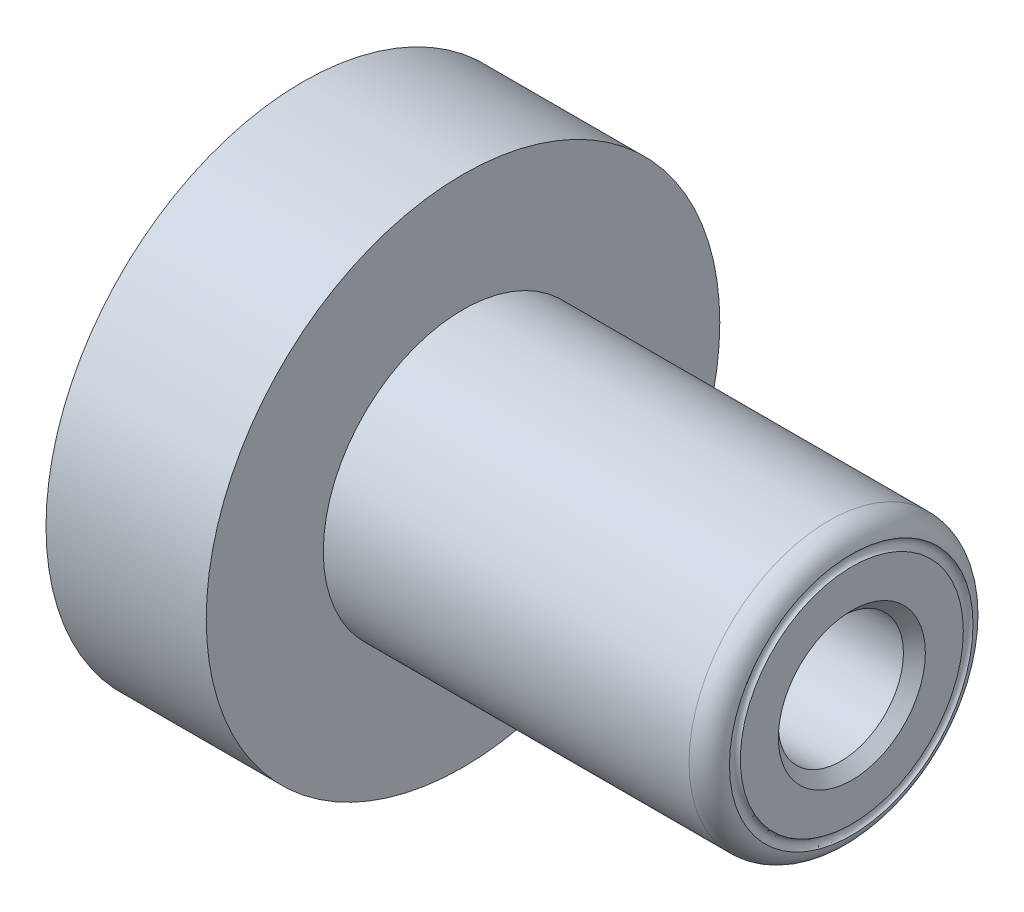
ISO-10303-21;
HEADER;
FILE_DESCRIPTION(('STEP AP214'),'2;1');
FILE_NAME('part.step','',(''),(''),'','','');
FILE_SCHEMA(('AUTOMOTIVE_DESIGN { 1 0 10303 214 1 1 1 1 }'));
ENDSEC;
DATA;
#1=APPLICATION_CONTEXT('core data for automotive mechanical design processes');
#2=APPLICATION_PROTOCOL_DEFINITION('international standard','automotive_design',2000,#1);
#3=PRODUCT_CONTEXT('',#1,'mechanical');
#4=PRODUCT('Part','Part','',(#3));
#5=PRODUCT_RELATED_PRODUCT_CATEGORY('part','',(#4));
#6=PRODUCT_DEFINITION_FORMATION('','',#4);
#7=PRODUCT_DEFINITION_CONTEXT('part definition',#1,'design');
#8=PRODUCT_DEFINITION('design','',#6,#7);
#9=PRODUCT_DEFINITION_SHAPE('','',#8);
#10=(LENGTH_UNIT() NAMED_UNIT(*) SI_UNIT(.MILLI.,.METRE.));
#11=(NAMED_UNIT(*) PLANE_ANGLE_UNIT() SI_UNIT($,.RADIAN.));
#12=(NAMED_UNIT(*) SI_UNIT($,.STERADIAN.) SOLID_ANGLE_UNIT());
#13=UNCERTAINTY_MEASURE_WITH_UNIT(LENGTH_MEASURE(1.E-05),#10,'distance_accuracy_value','');
#14=(GEOMETRIC_REPRESENTATION_CONTEXT(3) GLOBAL_UNCERTAINTY_ASSIGNED_CONTEXT((#13)) GLOBAL_UNIT_ASSIGNED_CONTEXT((#10,
#11,#12)) REPRESENTATION_CONTEXT('',''));
#15=CARTESIAN_POINT('',(0.,0.,0.));
#16=DIRECTION('',(0.,0.,1.));
#17=DIRECTION('',(1.,0.,0.));
#18=AXIS2_PLACEMENT_3D('',#15,#16,#17);
#19=CARTESIAN_POINT('',(37.338,7.9296,0.));
#20=DIRECTION('',(-1.,0.,0.));
#21=DIRECTION('',(0.,0.,1.));
#22=AXIS2_PLACEMENT_3D('',#19,#20,#21);
#23=PLANE('',#22);
#24=CARTESIAN_POINT('',(37.338,0.,0.));
#25=DIRECTION('',(-1.,0.,0.));
#26=DIRECTION('',(0.,0.,1.));
#27=AXIS2_PLACEMENT_3D('',#24,#25,#26);
#28=CIRCLE('',#27,5.);
#29=CARTESIAN_POINT('',(37.338,0.,-5.00000000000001));
#30=VERTEX_POINT('',#29);
#31=EDGE_CURVE('E10',#30,#30,#28,.T.);
#32=ORIENTED_EDGE('',*,*,#31,.T.);
#33=EDGE_LOOP('',(#32));
#34=FACE_BOUND('',#33,.T.);
#35=CARTESIAN_POINT('',(37.338,0.,0.));
#36=DIRECTION('',(1.,0.,0.));
#37=DIRECTION('',(0.,0.,-1.));
#38=AXIS2_PLACEMENT_3D('',#35,#36,#37);
#39=CIRCLE('',#38,7.58150313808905);
#40=CARTESIAN_POINT('',(37.338,0.,-7.58150313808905));
#41=VERTEX_POINT('',#40);
#42=EDGE_CURVE('E78',#41,#41,#39,.F.);
#43=ORIENTED_EDGE('',*,*,#42,.F.);
#44=EDGE_LOOP('',(#43));
#45=FACE_BOUND('',#44,.T.);
#46=ADVANCED_FACE('F31',(#34,#45),#23,.F.);
#47=CARTESIAN_POINT('',(35.768,0.,0.));
#48=DIRECTION('',(-1.,0.,0.));
#49=DIRECTION('',(0.,0.,1.));
#50=AXIS2_PLACEMENT_3D('',#47,#48,#49);
#51=TOROIDAL_SURFACE('',#50,7.9296,1.57);
#52=CARTESIAN_POINT('',(35.768,0.,0.));
#53=DIRECTION('',(-1.,0.,0.));
#54=DIRECTION('',(0.,0.,1.));
#55=AXIS2_PLACEMENT_3D('',#52,#53,#54);
#56=CIRCLE('',#55,9.4996);
#57=CARTESIAN_POINT('',(35.768,0.,9.4996));
#58=VERTEX_POINT('',#57);
#59=EDGE_CURVE('E48',#58,#58,#56,.T.);
#60=ORIENTED_EDGE('',*,*,#59,.F.);
#61=EDGE_LOOP('',(#60));
#62=FACE_BOUND('',#61,.T.);
#63=CARTESIAN_POINT('',(37.2980555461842,0.,0.));
#64=DIRECTION('',(1.,0.,0.));
#65=DIRECTION('',(0.,0.,-1.));
#66=AXIS2_PLACEMENT_3D('',#63,#64,#65);
#67=CIRCLE('',#66,8.28149490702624);
#68=CARTESIAN_POINT('',(37.2980555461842,0.,-8.28149490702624));
#69=VERTEX_POINT('',#68);
#70=EDGE_CURVE('E35',#69,#69,#67,.T.);
#71=ORIENTED_EDGE('',*,*,#70,.F.);
#72=EDGE_LOOP('',(#71));
#73=FACE_BOUND('',#72,.T.);
#74=ADVANCED_FACE('F87',(#62,#73),#51,.T.);
#75=CARTESIAN_POINT('',(0.,0.,0.));
#76=DIRECTION('',(-1.,0.,0.));
#77=DIRECTION('',(0.,0.,1.));
#78=AXIS2_PLACEMENT_3D('',#75,#76,#77);
#79=CYLINDRICAL_SURFACE('',#78,6.7437);
#80=CARTESIAN_POINT('',(20.447,0.,0.));
#81=DIRECTION('',(-1.,0.,0.));
#82=DIRECTION('',(0.,0.,1.));
#83=AXIS2_PLACEMENT_3D('',#80,#81,#82);
#84=CIRCLE('',#83,6.7437);
#85=CARTESIAN_POINT('',(20.447,0.,6.7437));
#86=VERTEX_POINT('',#85);
#87=EDGE_CURVE('E43',#86,#86,#84,.T.);
#88=ORIENTED_EDGE('',*,*,#87,.F.);
#89=EDGE_LOOP('',(#88));
#90=FACE_BOUND('',#89,.T.);
#91=CARTESIAN_POINT('',(0.,0.,0.));
#92=DIRECTION('',(-1.,0.,0.));
#93=DIRECTION('',(0.,0.,1.));
#94=AXIS2_PLACEMENT_3D('',#91,#92,#93);
#95=CIRCLE('',#94,6.7437);
#96=CARTESIAN_POINT('',(0.,0.,6.7437));
#97=VERTEX_POINT('',#96);
#98=EDGE_CURVE('E60',#97,#97,#95,.T.);
#99=ORIENTED_EDGE('',*,*,#98,.T.);
#100=EDGE_LOOP('',(#99));
#101=FACE_BOUND('',#100,.T.);
#102=ADVANCED_FACE('F89',(#90,#101),#79,.F.);
#103=CARTESIAN_POINT('',(20.447,6.7437,0.));
#104=DIRECTION('',(1.,0.,0.));
#105=DIRECTION('',(0.,0.,-1.));
#106=AXIS2_PLACEMENT_3D('',#103,#104,#105);
#107=PLANE('',#106);
#108=CARTESIAN_POINT('',(20.447,0.,0.));
#109=DIRECTION('',(1.,0.,0.));
#110=DIRECTION('',(0.,0.,-1.));
#111=AXIS2_PLACEMENT_3D('',#108,#109,#110);
#112=CIRCLE('',#111,4.255);
#113=CARTESIAN_POINT('',(20.447,0.,-4.255));
#114=VERTEX_POINT('',#113);
#115=EDGE_CURVE('E73',#114,#114,#112,.T.);
#116=ORIENTED_EDGE('',*,*,#115,.T.);
#117=EDGE_LOOP('',(#116));
#118=FACE_BOUND('',#117,.T.);
#119=ORIENTED_EDGE('',*,*,#87,.T.);
#120=EDGE_LOOP('',(#119));
#121=FACE_BOUND('',#120,.T.);
#122=ADVANCED_FACE('F96',(#118,#121),#107,.F.);
#123=CARTESIAN_POINT('',(0.,0.,0.));
#124=DIRECTION('',(-1.,0.,0.));
#125=DIRECTION('',(0.,0.,1.));
#126=AXIS2_PLACEMENT_3D('',#123,#124,#125);
#127=CYLINDRICAL_SURFACE('',#126,9.4996);
#128=CARTESIAN_POINT('',(10.8966,0.,0.));
#129=DIRECTION('',(-1.,0.,0.));
#130=DIRECTION('',(0.,0.,1.));
#131=AXIS2_PLACEMENT_3D('',#128,#129,#130);
#132=CIRCLE('',#131,9.4996);
#133=CARTESIAN_POINT('',(10.8966,0.,9.4996));
#134=VERTEX_POINT('',#133);
#135=EDGE_CURVE('E51',#134,#134,#132,.T.);
#136=ORIENTED_EDGE('',*,*,#135,.F.);
#137=EDGE_LOOP('',(#136));
#138=FACE_BOUND('',#137,.T.);
#139=ORIENTED_EDGE('',*,*,#59,.T.);
#140=EDGE_LOOP('',(#139));
#141=FACE_BOUND('',#140,.T.);
#142=ADVANCED_FACE('F101',(#138,#141),#127,.T.);
#143=CARTESIAN_POINT('',(10.8966,17.4625,0.));
#144=DIRECTION('',(-1.,0.,0.));
#145=DIRECTION('',(0.,0.,1.));
#146=AXIS2_PLACEMENT_3D('',#143,#144,#145);
#147=PLANE('',#146);
#148=CARTESIAN_POINT('',(10.8966,0.,0.));
#149=DIRECTION('',(-1.,0.,0.));
#150=DIRECTION('',(0.,0.,1.));
#151=AXIS2_PLACEMENT_3D('',#148,#149,#150);
#152=CIRCLE('',#151,17.4625);
#153=CARTESIAN_POINT('',(10.8966,0.,17.4625));
#154=VERTEX_POINT('',#153);
#155=EDGE_CURVE('E54',#154,#154,#152,.T.);
#156=ORIENTED_EDGE('',*,*,#155,.F.);
#157=EDGE_LOOP('',(#156));
#158=FACE_BOUND('',#157,.T.);
#159=ORIENTED_EDGE('',*,*,#135,.T.);
#160=EDGE_LOOP('',(#159));
#161=FACE_BOUND('',#160,.T.);
#162=ADVANCED_FACE('F109',(#158,#161),#147,.F.);
#163=CARTESIAN_POINT('',(0.,0.,0.));
#164=DIRECTION('',(-1.,0.,0.));
#165=DIRECTION('',(0.,0.,1.));
#166=AXIS2_PLACEMENT_3D('',#163,#164,#165);
#167=CYLINDRICAL_SURFACE('',#166,17.4625);
#168=CARTESIAN_POINT('',(0.,0.,0.));
#169=DIRECTION('',(-1.,0.,0.));
#170=DIRECTION('',(0.,0.,1.));
#171=AXIS2_PLACEMENT_3D('',#168,#169,#170);
#172=CIRCLE('',#171,17.4625);
#173=CARTESIAN_POINT('',(0.,0.,17.4625));
#174=VERTEX_POINT('',#173);
#175=EDGE_CURVE('E57',#174,#174,#172,.T.);
#176=ORIENTED_EDGE('',*,*,#175,.F.);
#177=EDGE_LOOP('',(#176));
#178=FACE_BOUND('',#177,.T.);
#179=ORIENTED_EDGE('',*,*,#155,.T.);
#180=EDGE_LOOP('',(#179));
#181=FACE_BOUND('',#180,.T.);
#182=ADVANCED_FACE('F121',(#178,#181),#167,.T.);
#183=CARTESIAN_POINT('',(0.,6.7437,0.));
#184=DIRECTION('',(1.,0.,0.));
#185=DIRECTION('',(0.,0.,-1.));
#186=AXIS2_PLACEMENT_3D('',#183,#184,#185);
#187=PLANE('',#186);
#188=CARTESIAN_POINT('',(0.,0.,11.1125));
#189=DIRECTION('',(-1.,0.,0.));
#190=DIRECTION('',(0.,0.,-1.));
#191=AXIS2_PLACEMENT_3D('',#188,#189,#190);
#192=CIRCLE('',#191,1.6129);
#193=CARTESIAN_POINT('',(0.,0.,9.4996));
#194=VERTEX_POINT('',#193);
#195=EDGE_CURVE('E70',#194,#194,#192,.T.);
#196=ORIENTED_EDGE('',*,*,#195,.F.);
#197=EDGE_LOOP('',(#196));
#198=FACE_BOUND('',#197,.T.);
#199=CARTESIAN_POINT('',(0.,0.,-11.1125));
#200=DIRECTION('',(-1.,0.,0.));
#201=DIRECTION('',(0.,0.,1.));
#202=AXIS2_PLACEMENT_3D('',#199,#200,#201);
#203=CIRCLE('',#202,1.6129);
#204=CARTESIAN_POINT('',(0.,0.,-9.4996));
#205=VERTEX_POINT('',#204);
#206=EDGE_CURVE('E64',#205,#205,#203,.T.);
#207=ORIENTED_EDGE('',*,*,#206,.F.);
#208=EDGE_LOOP('',(#207));
#209=FACE_BOUND('',#208,.T.);
#210=ORIENTED_EDGE('',*,*,#98,.F.);
#211=EDGE_LOOP('',(#210));
#212=FACE_BOUND('',#211,.T.);
#213=ORIENTED_EDGE('',*,*,#175,.T.);
#214=EDGE_LOOP('',(#213));
#215=FACE_BOUND('',#214,.T.);
#216=ADVANCED_FACE('F117',(#198,#209,#212,#215),#187,.F.);
#217=CARTESIAN_POINT('',(6.35,0.,-11.1125));
#218=DIRECTION('',(-1.,0.,0.));
#219=DIRECTION('',(0.,0.,1.));
#220=AXIS2_PLACEMENT_3D('',#217,#218,#219);
#221=CYLINDRICAL_SURFACE('',#220,1.6129);
#222=CARTESIAN_POINT('',(6.35,0.,-11.1125));
#223=DIRECTION('',(-1.,0.,0.));
#224=DIRECTION('',(0.,0.,1.));
#225=AXIS2_PLACEMENT_3D('',#222,#223,#224);
#226=CIRCLE('',#225,1.6129);
#227=CARTESIAN_POINT('',(6.35,0.,-9.4996));
#228=VERTEX_POINT('',#227);
#229=EDGE_CURVE('E63',#228,#228,#226,.T.);
#230=ORIENTED_EDGE('',*,*,#229,.F.);
#231=EDGE_LOOP('',(#230));
#232=FACE_BOUND('',#231,.T.);
#233=ORIENTED_EDGE('',*,*,#206,.T.);
#234=EDGE_LOOP('',(#233));
#235=FACE_BOUND('',#234,.T.);
#236=ADVANCED_FACE('F120',(#232,#235),#221,.F.);
#237=CARTESIAN_POINT('',(6.35,0.,-11.1125));
#238=DIRECTION('',(-1.,0.,0.));
#239=DIRECTION('',(0.,0.,1.));
#240=AXIS2_PLACEMENT_3D('',#237,#238,#239);
#241=PLANE('',#240);
#242=ORIENTED_EDGE('',*,*,#229,.T.);
#243=EDGE_LOOP('',(#242));
#244=FACE_BOUND('',#243,.T.);
#245=ADVANCED_FACE('F140',(#244),#241,.T.);
#246=CARTESIAN_POINT('',(6.35,0.,11.1125));
#247=DIRECTION('',(-1.,0.,0.));
#248=DIRECTION('',(0.,0.,1.));
#249=AXIS2_PLACEMENT_3D('',#246,#247,#248);
#250=CYLINDRICAL_SURFACE('',#249,1.6129);
#251=CARTESIAN_POINT('',(6.35,0.,11.1125));
#252=DIRECTION('',(-1.,0.,0.));
#253=DIRECTION('',(0.,0.,-1.));
#254=AXIS2_PLACEMENT_3D('',#251,#252,#253);
#255=CIRCLE('',#254,1.6129);
#256=CARTESIAN_POINT('',(6.35,0.,9.4996));
#257=VERTEX_POINT('',#256);
#258=EDGE_CURVE('E67',#257,#257,#255,.T.);
#259=ORIENTED_EDGE('',*,*,#258,.F.);
#260=EDGE_LOOP('',(#259));
#261=FACE_BOUND('',#260,.T.);
#262=ORIENTED_EDGE('',*,*,#195,.T.);
#263=EDGE_LOOP('',(#262));
#264=FACE_BOUND('',#263,.T.);
#265=ADVANCED_FACE('F144',(#261,#264),#250,.F.);
#266=CARTESIAN_POINT('',(6.35,0.,11.1125));
#267=DIRECTION('',(1.,0.,0.));
#268=DIRECTION('',(0.,0.,-1.));
#269=AXIS2_PLACEMENT_3D('',#266,#267,#268);
#270=PLANE('',#269);
#271=ORIENTED_EDGE('',*,*,#258,.T.);
#272=EDGE_LOOP('',(#271));
#273=FACE_BOUND('',#272,.T.);
#274=ADVANCED_FACE('F148',(#273),#270,.F.);
#275=CARTESIAN_POINT('',(0.,0.,0.));
#276=DIRECTION('',(1.,0.,0.));
#277=DIRECTION('',(0.,0.,-1.));
#278=AXIS2_PLACEMENT_3D('',#275,#276,#277);
#279=CYLINDRICAL_SURFACE('',#278,4.255);
#280=CARTESIAN_POINT('',(36.593,0.,0.));
#281=DIRECTION('',(-1.,0.,0.));
#282=DIRECTION('',(0.,0.,1.));
#283=AXIS2_PLACEMENT_3D('',#280,#281,#282);
#284=CIRCLE('',#283,4.255);
#285=CARTESIAN_POINT('',(36.593,0.,-4.255));
#286=VERTEX_POINT('',#285);
#287=EDGE_CURVE('E39',#286,#286,#284,.F.);
#288=ORIENTED_EDGE('',*,*,#287,.T.);
#289=EDGE_LOOP('',(#288));
#290=FACE_BOUND('',#289,.T.);
#291=ORIENTED_EDGE('',*,*,#115,.F.);
#292=EDGE_LOOP('',(#291));
#293=FACE_BOUND('',#292,.T.);
#294=ADVANCED_FACE('F152',(#290,#293),#279,.F.);
#295=CARTESIAN_POINT('',(36.593,0.,0.));
#296=DIRECTION('',(1.,0.,0.));
#297=DIRECTION('',(0.,0.,-1.));
#298=AXIS2_PLACEMENT_3D('',#295,#296,#297);
#299=CONICAL_SURFACE('',#298,4.255,0.785398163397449);
#300=CARTESIAN_POINT('',(37.338,0.,-5.00000000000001));
#301=CARTESIAN_POINT('',(37.3302395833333,0.,-4.99223958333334));
#302=CARTESIAN_POINT('',(37.3224791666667,0.,-4.98447916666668));
#303=CARTESIAN_POINT('',(37.3069583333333,0.,-4.96895833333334));
#304=CARTESIAN_POINT('',(37.2991979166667,0.,-4.96119791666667));
#305=CARTESIAN_POINT('',(37.2836770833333,0.,-4.94567708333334));
#306=CARTESIAN_POINT('',(37.2759166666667,0.,-4.93791666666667));
#307=CARTESIAN_POINT('',(37.2603958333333,0.,-4.92239583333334));
#308=CARTESIAN_POINT('',(37.2526354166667,0.,-4.91463541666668));
#309=CARTESIAN_POINT('',(37.2371145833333,0.,-4.89911458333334));
#310=CARTESIAN_POINT('',(37.2293541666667,0.,-4.89135416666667));
#311=CARTESIAN_POINT('',(37.2138333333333,0.,-4.87583333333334));
#312=CARTESIAN_POINT('',(37.2060729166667,0.,-4.86807291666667));
#313=CARTESIAN_POINT('',(37.1905520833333,0.,-4.85255208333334));
#314=CARTESIAN_POINT('',(37.1827916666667,0.,-4.84479166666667));
#315=CARTESIAN_POINT('',(37.1672708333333,0.,-4.82927083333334));
#316=CARTESIAN_POINT('',(37.1595104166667,0.,-4.82151041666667));
#317=CARTESIAN_POINT('',(37.1439895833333,0.,-4.80598958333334));
#318=CARTESIAN_POINT('',(37.1362291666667,0.,-4.79822916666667));
#319=CARTESIAN_POINT('',(37.1207083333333,0.,-4.78270833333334));
#320=CARTESIAN_POINT('',(37.1129479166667,0.,-4.77494791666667));
#321=CARTESIAN_POINT('',(37.0974270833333,0.,-4.75942708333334));
#322=CARTESIAN_POINT('',(37.0896666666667,0.,-4.75166666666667));
#323=CARTESIAN_POINT('',(37.0741458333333,0.,-4.73614583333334));
#324=CARTESIAN_POINT('',(37.0663854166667,0.,-4.72838541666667));
#325=CARTESIAN_POINT('',(37.0508645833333,0.,-4.71286458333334));
#326=CARTESIAN_POINT('',(37.0431041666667,0.,-4.70510416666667));
#327=CARTESIAN_POINT('',(37.0275833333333,0.,-4.68958333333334));
#328=CARTESIAN_POINT('',(37.0198229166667,0.,-4.68182291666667));
#329=CARTESIAN_POINT('',(37.0043020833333,0.,-4.66630208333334));
#330=CARTESIAN_POINT('',(36.9965416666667,0.,-4.65854166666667));
#331=CARTESIAN_POINT('',(36.9810208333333,0.,-4.64302083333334));
#332=CARTESIAN_POINT('',(36.9732604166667,0.,-4.63526041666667));
#333=CARTESIAN_POINT('',(36.9577395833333,0.,-4.61973958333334));
#334=CARTESIAN_POINT('',(36.9499791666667,0.,-4.61197916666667));
#335=CARTESIAN_POINT('',(36.9344583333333,0.,-4.59645833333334));
#336=CARTESIAN_POINT('',(36.9266979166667,0.,-4.58869791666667));
#337=CARTESIAN_POINT('',(36.9111770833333,0.,-4.57317708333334));
#338=CARTESIAN_POINT('',(36.9034166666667,0.,-4.56541666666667));
#339=CARTESIAN_POINT('',(36.8878958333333,0.,-4.54989583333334));
#340=CARTESIAN_POINT('',(36.8801354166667,0.,-4.54213541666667));
#341=CARTESIAN_POINT('',(36.8646145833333,0.,-4.52661458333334));
#342=CARTESIAN_POINT('',(36.8568541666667,0.,-4.51885416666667));
#343=CARTESIAN_POINT('',(36.8413333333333,0.,-4.50333333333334));
#344=CARTESIAN_POINT('',(36.8335729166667,0.,-4.49557291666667));
#345=CARTESIAN_POINT('',(36.8180520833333,0.,-4.48005208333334));
#346=CARTESIAN_POINT('',(36.8102916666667,0.,-4.47229166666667));
#347=CARTESIAN_POINT('',(36.7947708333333,0.,-4.45677083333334));
#348=CARTESIAN_POINT('',(36.7870104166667,0.,-4.44901041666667));
#349=CARTESIAN_POINT('',(36.7714895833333,0.,-4.43348958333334));
#350=CARTESIAN_POINT('',(36.7637291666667,0.,-4.42572916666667));
#351=CARTESIAN_POINT('',(36.7482083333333,0.,-4.41020833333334));
#352=CARTESIAN_POINT('',(36.7404479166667,0.,-4.40244791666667));
#353=CARTESIAN_POINT('',(36.7249270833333,0.,-4.38692708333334));
#354=CARTESIAN_POINT('',(36.7171666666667,0.,-4.37916666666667));
#355=CARTESIAN_POINT('',(36.7016458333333,0.,-4.36364583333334));
#356=CARTESIAN_POINT('',(36.6938854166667,0.,-4.35588541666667));
#357=CARTESIAN_POINT('',(36.6783645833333,0.,-4.34036458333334));
#358=CARTESIAN_POINT('',(36.6706041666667,0.,-4.33260416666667));
#359=CARTESIAN_POINT('',(36.6550833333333,0.,-4.31708333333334));
#360=CARTESIAN_POINT('',(36.6473229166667,0.,-4.30932291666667));
#361=CARTESIAN_POINT('',(36.6318020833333,0.,-4.29380208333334));
#362=CARTESIAN_POINT('',(36.6240416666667,0.,-4.28604166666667));
#363=CARTESIAN_POINT('',(36.6085208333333,0.,-4.27052083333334));
#364=CARTESIAN_POINT('',(36.6007604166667,0.,-4.26276041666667));
#365=CARTESIAN_POINT('',(36.593,0.,-4.255));
#366=B_SPLINE_CURVE_WITH_KNOTS('',3,(#300,#301,#302,#303,#304,#305,#306,#307,#308,#309,#310,
#311,#312,#313,#314,#315,#316,#317,#318,#319,#320,#321,#322,#323,#324,#325,#326,#327,#328,#329,
#330,#331,#332,#333,#334,#335,#336,#337,#338,#339,#340,#341,#342,#343,#344,#345,#346,#347,#348,
#349,#350,#351,#352,#353,#354,#355,#356,#357,#358,#359,#360,#361,#362,#363,#364,#365),
.UNSPECIFIED.,.F.,.F.,(4,2,2,2,2,2,2,2,2,2,2,2,2,2,2,2,2,2,2,2,2,2,2,2,2,2,2,2,2,2,2,2,4),(0.,
0.0329246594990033,0.0658493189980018,0.0987739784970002,0.131698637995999,0.164623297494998,
0.197547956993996,0.230472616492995,0.263397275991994,0.296321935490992,0.32924659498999,
0.362171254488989,0.395095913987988,0.428020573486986,0.460945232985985,0.493869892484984,
0.526794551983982,0.559719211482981,0.59264387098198,0.625568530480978,0.658493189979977,
0.691417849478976,0.724342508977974,0.757267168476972,0.790191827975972,0.82311648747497,
0.856041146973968,0.888965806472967,0.921890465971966,0.954815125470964,0.987739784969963,
1.02066444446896,1.05358910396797),.UNSPECIFIED.);
#367=EDGE_CURVE('BSEAM33',#30,#286,#366,.T.);
#368=ORIENTED_EDGE('',*,*,#31,.F.);
#369=ORIENTED_EDGE('',*,*,#287,.F.);
#370=ORIENTED_EDGE('',*,*,#367,.T.);
#371=ORIENTED_EDGE('',*,*,#367,.F.);
#372=EDGE_LOOP('',(#368,#370,#369,#371));
#373=FACE_BOUND('',#372,.T.);
#374=ADVANCED_FACE('F33',(#373),#299,.F.);
#375=CARTESIAN_POINT('',(37.467,0.,0.));
#376=DIRECTION('',(-1.,0.,0.));
#377=DIRECTION('',(0.,0.,1.));
#378=AXIS2_PLACEMENT_3D('',#375,#376,#377);
#379=TOROIDAL_SURFACE('',#378,7.94,0.381000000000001);
#380=ORIENTED_EDGE('',*,*,#70,.T.);
#381=EDGE_LOOP('',(#380));
#382=FACE_BOUND('',#381,.T.);
#383=ORIENTED_EDGE('',*,*,#42,.T.);
#384=EDGE_LOOP('',(#383));
#385=FACE_BOUND('',#384,.T.);
#386=ADVANCED_FACE('F85',(#382,#385),#379,.F.);
#387=CLOSED_SHELL('',(#46,#74,#102,#122,#142,#162,#182,#216,#236,#245,#265,#274,#294,#374,#386));
#388=MANIFOLD_SOLID_BREP('B2',#387);
#389=ADVANCED_BREP_SHAPE_REPRESENTATION('',(#18,#388),#14);
#390=SHAPE_DEFINITION_REPRESENTATION(#9,#389);
ENDSEC;
END-ISO-10303-21;
